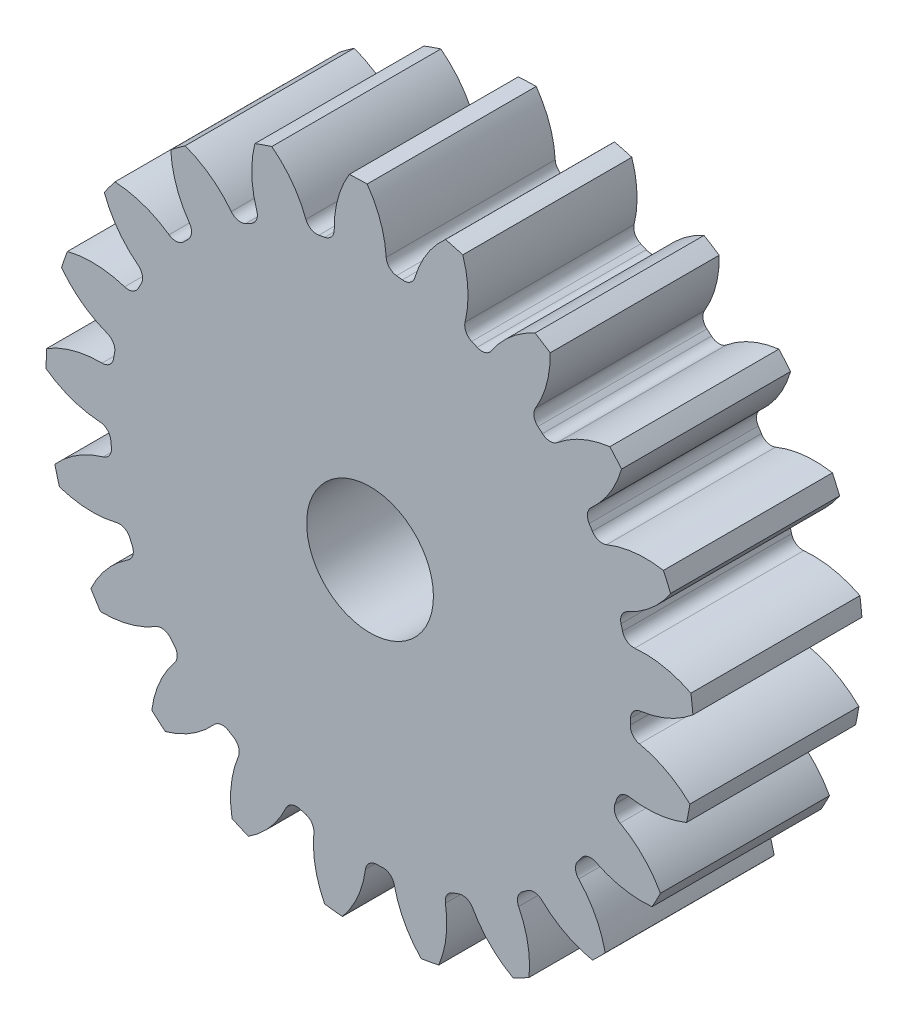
from build123d import *

# Parameters (mm, degrees)
SKETCH3_R         = 194.733333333
GEARBODY_DEPTH    = 101.6
TOOTHCUT_DEPTH    = 294.538246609
CIRPATTERN1_COUNT = 21
BOREDIA_R         = 38.1
BORE_DEPTH        = 12700


with BuildPart() as part:
    # Sketch3 → gearBody (new body)
    with BuildSketch(Plane.XY):
        Circle(SKETCH3_R)
    extrude(amount=GEARBODY_DEPTH)

    # Sketch2 → toothCut (cut, through all)
    with BuildSketch(Plane.XY):
        with BuildLine():
            ThreePointArc((156.439449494, -7.791004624), (156.518650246, -5.992765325), (156.577181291, -4.193734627))
            ThreePointArc((156.577181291, -4.193734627), (158.342543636, 0.230656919), (162.555876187, 2.453172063))
            ThreePointArc((162.555876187, 2.453172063), (179.688658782, 7.316534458), (194.733333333, 16.847657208))
            ThreePointArc((194.733333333, 16.847657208), (195.31766367, -7.478296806), (192.874992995, -31.688353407))
            ThreePointArc((192.874992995, -31.688353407), (178.60314804, -21.034763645), (161.892394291, -14.875604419))
            ThreePointArc((161.892394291, -14.875604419), (157.86133842, -12.337429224), (156.439449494, -7.791004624))
        make_face()
    toothcut = extrude(amount=TOOTHCUT_DEPTH, mode=Mode.SUBTRACT)

    # CirPattern1: toothCut ×21 about axis
    cirpattern1_axis = Axis((0, 0, 0), (0, 0, 1))
    for i in range(1, CIRPATTERN1_COUNT):
        add(toothcut.rotate(cirpattern1_axis, i * 360 / CIRPATTERN1_COUNT), mode=Mode.SUBTRACT)

    # boreDia → bore (cut, symmetric)
    with BuildSketch(Plane.XY):
        Circle(BOREDIA_R)
    extrude(amount=BORE_DEPTH, both=True, mode=Mode.SUBTRACT)


solid = part.part
